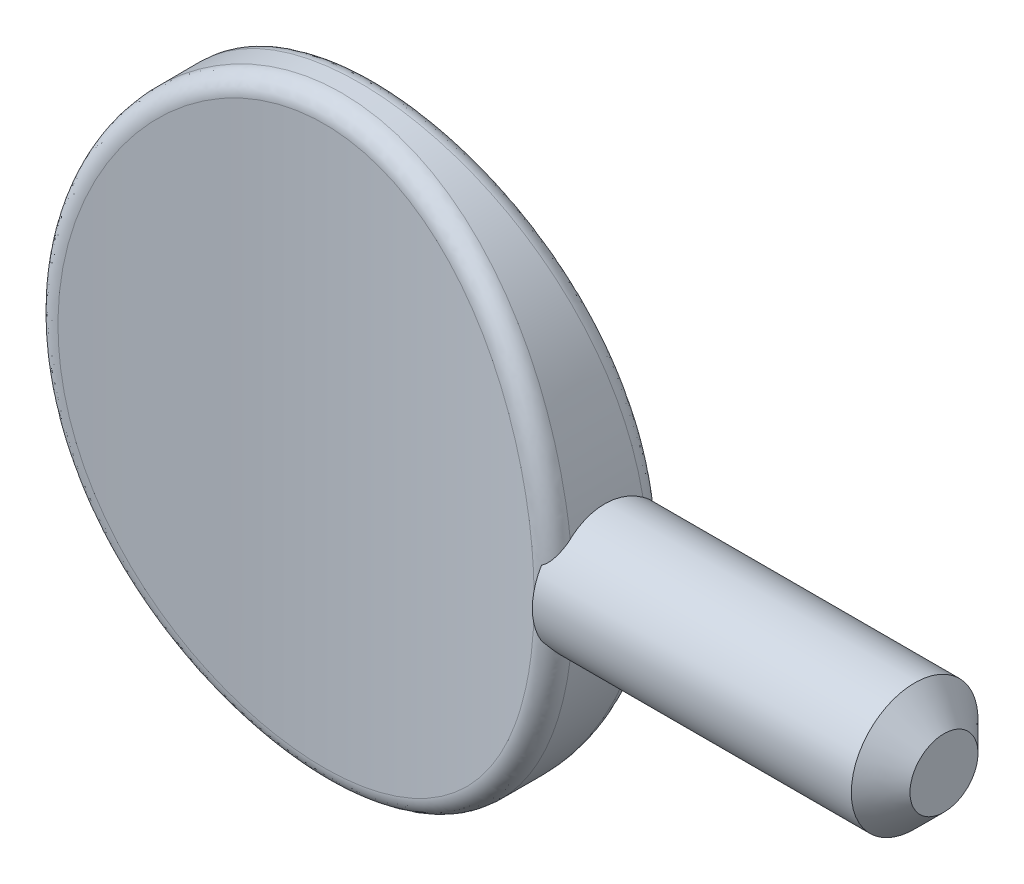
from build123d import *

# Parameters (mm, degrees)
SKETCH1_RX              = 11.303
SKETCH1_RY              = 9.906
EXTRUDE1_DEPTH          = 2.286
CUT_EXTRUDE1_DEPTH      = 16.202382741
CUT_EXTRUDE1_DEPTH_BACK = 16.202382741
SKETCH2_OUTSIDE_W       = 27.892
SKETCH2_OUTSIDE_H       = 12.652
FILLET3_R               = 0.677333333


with BuildPart() as part:
    # Sketch1 → Extrude1 (new, symmetric)
    with BuildSketch(Plane.XY):
        with Locations(Location((0, 0), (0, 0, -90))):
            Ellipse(SKETCH1_RX, SKETCH1_RY)
    extrude(amount=EXTRUDE1_DEPTH, both=True)

    # Sketch2 outside → Cut-Extrude1 (cut, two sides: drawn at the far end of the back side and taken through both)
    with BuildSketch(Plane(origin=(0, 0, 0), x_dir=(1, 0, 0), z_dir=(0, 1, 0)).offset(-CUT_EXTRUDE1_DEPTH_BACK)):
        Rectangle(SKETCH2_OUTSIDE_W, SKETCH2_OUTSIDE_H)
        with BuildLine():
            Line((-9.906, 2.286), (-9.906, -2.286))
            ThreePointArc((-9.906, -2.286), (0, -1.016), (9.906, -2.286))
            Line((9.906, -2.286), (9.906, 2.286))
            ThreePointArc((9.906, 2.286), (0, 1.016), (-9.906, 2.286))
        make_face(mode=Mode.SUBTRACT)
    extrude(amount=CUT_EXTRUDE1_DEPTH + CUT_EXTRUDE1_DEPTH_BACK, mode=Mode.SUBTRACT)

    # Fillet3
    fillet3_edges = [part.edges().sort_by_distance(p)[0] for p in [
        (-7.228513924, -7.728494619, 1.687044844),
        (3.75e-07, 11.303, -1.016),
    ]]
    fillet(fillet3_edges, radius=FILLET3_R)

    # Sketch3 → Revolve1 (revolve)
    with BuildSketch(Plane(origin=(0, 0, 0), x_dir=(1, 0, 0), z_dir=(0, 1, 0)), mode=Mode.PRIVATE) as revolve1_sk:
        with BuildLine():
            Line((22.606, 0), (22.606, 1.2954))
            Line((22.606, 1.2954), (21.4884, 2.413))
            Line((21.4884, 2.413), (13.208, 2.413))
            Line((13.208, 2.413), (9.336678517, 2.413))
            ThreePointArc((9.336678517, 2.413), (9.262571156, 2.199720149), (9.072182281, 2.078343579))
            Line((9.072182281, 2.078343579), (9.072182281, 0))
            Line((9.072182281, 0), (22.606, 0))
        make_face()
    revolve(revolve1_sk.sketch.rotate(Axis((0, 0, 0), (1, 0, 0)), 180), axis=Axis((0, 0, 0), (1, 0, 0)))


solid = part.part
